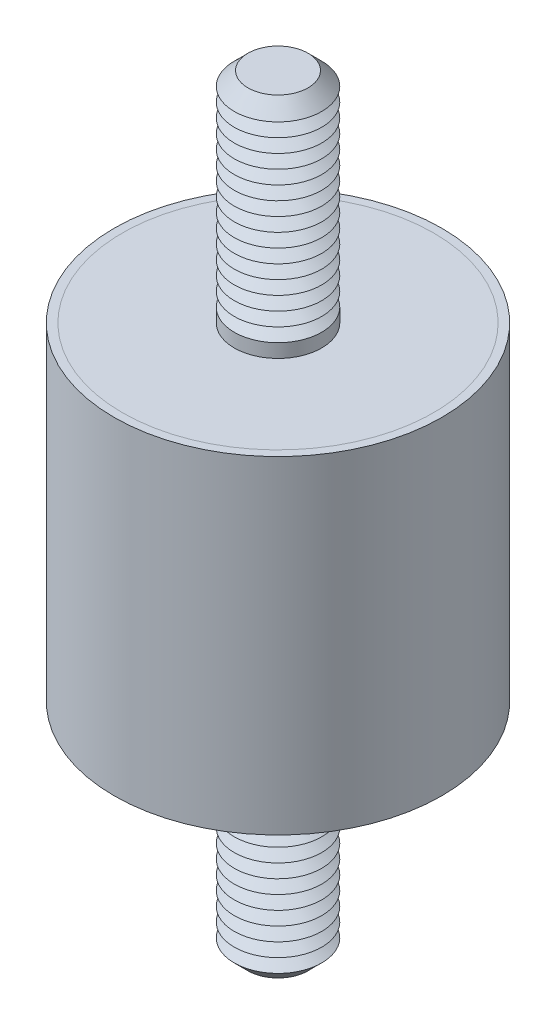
ISO-10303-21;
HEADER;
FILE_DESCRIPTION(('STEP AP214'),'2;1');
FILE_NAME('part.step','',(''),(''),'','','');
FILE_SCHEMA(('AUTOMOTIVE_DESIGN { 1 0 10303 214 1 1 1 1 }'));
ENDSEC;
DATA;
#1=APPLICATION_CONTEXT('core data for automotive mechanical design processes');
#2=APPLICATION_PROTOCOL_DEFINITION('international standard','automotive_design',2000,#1);
#3=PRODUCT_CONTEXT('',#1,'mechanical');
#4=PRODUCT('Part','Part','',(#3));
#5=PRODUCT_RELATED_PRODUCT_CATEGORY('part','',(#4));
#6=PRODUCT_DEFINITION_FORMATION('','',#4);
#7=PRODUCT_DEFINITION_CONTEXT('part definition',#1,'design');
#8=PRODUCT_DEFINITION('design','',#6,#7);
#9=PRODUCT_DEFINITION_SHAPE('','',#8);
#10=(LENGTH_UNIT() NAMED_UNIT(*) SI_UNIT(.MILLI.,.METRE.));
#11=(NAMED_UNIT(*) PLANE_ANGLE_UNIT() SI_UNIT($,.RADIAN.));
#12=(NAMED_UNIT(*) SI_UNIT($,.STERADIAN.) SOLID_ANGLE_UNIT());
#13=UNCERTAINTY_MEASURE_WITH_UNIT(LENGTH_MEASURE(1.E-05),#10,'distance_accuracy_value','');
#14=(GEOMETRIC_REPRESENTATION_CONTEXT(3) GLOBAL_UNCERTAINTY_ASSIGNED_CONTEXT((#13)) GLOBAL_UNIT_ASSIGNED_CONTEXT((#10,
#11,#12)) REPRESENTATION_CONTEXT('',''));
#15=CARTESIAN_POINT('',(0.,0.,0.));
#16=DIRECTION('',(0.,0.,1.));
#17=DIRECTION('',(1.,0.,0.));
#18=AXIS2_PLACEMENT_3D('',#15,#16,#17);
#19=CARTESIAN_POINT('',(0.,-35.,0.));
#20=DIRECTION('',(0.,1.,0.));
#21=DIRECTION('',(0.,0.,1.));
#22=AXIS2_PLACEMENT_3D('',#19,#20,#21);
#23=CYLINDRICAL_SURFACE('',#22,4.);
#24=CARTESIAN_POINT('',(0.,-15.,0.));
#25=DIRECTION('',(0.,-1.,0.));
#26=DIRECTION('',(0.,0.,-1.));
#27=AXIS2_PLACEMENT_3D('',#24,#25,#26);
#28=CIRCLE('',#27,4.);
#29=CARTESIAN_POINT('',(0.,-15.,-4.));
#30=VERTEX_POINT('',#29);
#31=EDGE_CURVE('P0_E21',#30,#30,#28,.T.);
#32=ORIENTED_EDGE('',*,*,#31,.T.);
#33=EDGE_LOOP('',(#32));
#34=FACE_BOUND('',#33,.T.);
#35=CARTESIAN_POINT('',(0.,-16.25,0.));
#36=DIRECTION('',(0.,1.,0.));
#37=DIRECTION('',(0.,0.,1.));
#38=AXIS2_PLACEMENT_3D('',#35,#36,#37);
#39=CIRCLE('',#38,4.);
#40=CARTESIAN_POINT('',(0.,-16.25,4.));
#41=VERTEX_POINT('',#40);
#42=EDGE_CURVE('P0_E33',#41,#41,#39,.T.);
#43=ORIENTED_EDGE('',*,*,#42,.T.);
#44=EDGE_LOOP('',(#43));
#45=FACE_BOUND('',#44,.T.);
#46=ADVANCED_FACE('P0_F14',(#34,#45),#23,.T.);
#47=CARTESIAN_POINT('',(0.,-15.,0.));
#48=DIRECTION('',(0.,1.,0.));
#49=DIRECTION('',(0.,0.,1.));
#50=AXIS2_PLACEMENT_3D('',#47,#48,#49);
#51=CYLINDRICAL_SURFACE('',#50,14.25);
#52=CARTESIAN_POINT('',(0.,-15.,0.));
#53=DIRECTION('',(0.,1.,0.));
#54=DIRECTION('',(0.,0.,1.));
#55=AXIS2_PLACEMENT_3D('',#52,#53,#54);
#56=CIRCLE('',#55,14.25);
#57=CARTESIAN_POINT('',(0.,-15.,14.25));
#58=VERTEX_POINT('',#57);
#59=EDGE_CURVE('P0_E25',#58,#58,#56,.T.);
#60=ORIENTED_EDGE('',*,*,#59,.T.);
#61=EDGE_LOOP('',(#60));
#62=FACE_BOUND('',#61,.T.);
#63=CARTESIAN_POINT('',(0.,-13.5,0.));
#64=DIRECTION('',(0.,1.,0.));
#65=DIRECTION('',(0.,0.,1.));
#66=AXIS2_PLACEMENT_3D('',#63,#64,#65);
#67=CIRCLE('',#66,14.25);
#68=CARTESIAN_POINT('',(0.,-13.5,14.25));
#69=VERTEX_POINT('',#68);
#70=EDGE_CURVE('P0_E30',#69,#69,#67,.T.);
#71=ORIENTED_EDGE('',*,*,#70,.F.);
#72=EDGE_LOOP('',(#71));
#73=FACE_BOUND('',#72,.T.);
#74=ADVANCED_FACE('P0_F145',(#62,#73),#51,.T.);
#75=CARTESIAN_POINT('',(0.,-15.,0.));
#76=DIRECTION('',(0.,1.,0.));
#77=DIRECTION('',(0.,0.,1.));
#78=AXIS2_PLACEMENT_3D('',#75,#76,#77);
#79=PLANE('',#78);
#80=ORIENTED_EDGE('',*,*,#31,.F.);
#81=EDGE_LOOP('',(#80));
#82=FACE_BOUND('',#81,.T.);
#83=ORIENTED_EDGE('',*,*,#59,.F.);
#84=EDGE_LOOP('',(#83));
#85=FACE_BOUND('',#84,.T.);
#86=ADVANCED_FACE('P0_F150',(#82,#85),#79,.F.);
#87=CARTESIAN_POINT('',(0.,-13.5,0.));
#88=DIRECTION('',(0.,1.,0.));
#89=DIRECTION('',(0.,0.,1.));
#90=AXIS2_PLACEMENT_3D('',#87,#88,#89);
#91=PLANE('',#90);
#92=ORIENTED_EDGE('',*,*,#70,.T.);
#93=EDGE_LOOP('',(#92));
#94=FACE_BOUND('',#93,.T.);
#95=ADVANCED_FACE('P0_F156',(#94),#91,.T.);
#96=CARTESIAN_POINT('',(0.,-16.25,0.));
#97=DIRECTION('',(0.,1.,0.));
#98=DIRECTION('',(0.,0.,1.));
#99=AXIS2_PLACEMENT_3D('',#96,#97,#98);
#100=CONICAL_SURFACE('',#99,4.,1.0471975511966);
#101=CARTESIAN_POINT('',(0.,-16.875,0.));
#102=DIRECTION('',(0.,1.,0.));
#103=DIRECTION('',(0.,0.,1.));
#104=AXIS2_PLACEMENT_3D('',#101,#102,#103);
#105=CIRCLE('',#104,2.91746824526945);
#106=CARTESIAN_POINT('',(0.,-16.875,2.91746824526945));
#107=VERTEX_POINT('',#106);
#108=EDGE_CURVE('P0_E39',#107,#107,#105,.T.);
#109=ORIENTED_EDGE('',*,*,#108,.T.);
#110=EDGE_LOOP('',(#109));
#111=FACE_BOUND('',#110,.T.);
#112=ORIENTED_EDGE('',*,*,#42,.F.);
#113=EDGE_LOOP('',(#112));
#114=FACE_BOUND('',#113,.T.);
#115=ADVANCED_FACE('P0_F159',(#111,#114),#100,.T.);
#116=CARTESIAN_POINT('',(0.,-16.875,0.));
#117=DIRECTION('',(0.,-1.,0.));
#118=DIRECTION('',(0.,0.,-1.));
#119=AXIS2_PLACEMENT_3D('',#116,#117,#118);
#120=CONICAL_SURFACE('',#119,2.91746824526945,1.04719755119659);
#121=CARTESIAN_POINT('',(0.,-17.5,0.));
#122=DIRECTION('',(0.,1.,0.));
#123=DIRECTION('',(0.,0.,1.));
#124=AXIS2_PLACEMENT_3D('',#121,#122,#123);
#125=CIRCLE('',#124,4.);
#126=CARTESIAN_POINT('',(0.,-17.5,4.));
#127=VERTEX_POINT('',#126);
#128=EDGE_CURVE('P0_E43',#127,#127,#125,.T.);
#129=ORIENTED_EDGE('',*,*,#128,.T.);
#130=EDGE_LOOP('',(#129));
#131=FACE_BOUND('',#130,.T.);
#132=ORIENTED_EDGE('',*,*,#108,.F.);
#133=EDGE_LOOP('',(#132));
#134=FACE_BOUND('',#133,.T.);
#135=ADVANCED_FACE('P0_F163',(#131,#134),#120,.T.);
#136=CARTESIAN_POINT('',(0.,-17.5,0.));
#137=DIRECTION('',(0.,1.,0.));
#138=DIRECTION('',(0.,0.,1.));
#139=AXIS2_PLACEMENT_3D('',#136,#137,#138);
#140=CONICAL_SURFACE('',#139,4.,1.0471975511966);
#141=CARTESIAN_POINT('',(0.,-18.125,0.));
#142=DIRECTION('',(0.,1.,0.));
#143=DIRECTION('',(0.,0.,1.));
#144=AXIS2_PLACEMENT_3D('',#141,#142,#143);
#145=CIRCLE('',#144,2.91746824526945);
#146=CARTESIAN_POINT('',(0.,-18.125,2.91746824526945));
#147=VERTEX_POINT('',#146);
#148=EDGE_CURVE('P0_E47',#147,#147,#145,.T.);
#149=ORIENTED_EDGE('',*,*,#148,.T.);
#150=EDGE_LOOP('',(#149));
#151=FACE_BOUND('',#150,.T.);
#152=ORIENTED_EDGE('',*,*,#128,.F.);
#153=EDGE_LOOP('',(#152));
#154=FACE_BOUND('',#153,.T.);
#155=ADVANCED_FACE('P0_F167',(#151,#154),#140,.T.);
#156=CARTESIAN_POINT('',(0.,-18.125,0.));
#157=DIRECTION('',(0.,-1.,0.));
#158=DIRECTION('',(0.,0.,-1.));
#159=AXIS2_PLACEMENT_3D('',#156,#157,#158);
#160=CONICAL_SURFACE('',#159,2.91746824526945,1.04719755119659);
#161=CARTESIAN_POINT('',(0.,-18.75,0.));
#162=DIRECTION('',(0.,1.,0.));
#163=DIRECTION('',(0.,0.,1.));
#164=AXIS2_PLACEMENT_3D('',#161,#162,#163);
#165=CIRCLE('',#164,4.);
#166=CARTESIAN_POINT('',(0.,-18.75,4.));
#167=VERTEX_POINT('',#166);
#168=EDGE_CURVE('P0_E52',#167,#167,#165,.T.);
#169=ORIENTED_EDGE('',*,*,#168,.T.);
#170=EDGE_LOOP('',(#169));
#171=FACE_BOUND('',#170,.T.);
#172=ORIENTED_EDGE('',*,*,#148,.F.);
#173=EDGE_LOOP('',(#172));
#174=FACE_BOUND('',#173,.T.);
#175=ADVANCED_FACE('P0_F174',(#171,#174),#160,.T.);
#176=CARTESIAN_POINT('',(0.,-18.75,0.));
#177=DIRECTION('',(0.,1.,0.));
#178=DIRECTION('',(0.,0.,1.));
#179=AXIS2_PLACEMENT_3D('',#176,#177,#178);
#180=CONICAL_SURFACE('',#179,4.,1.0471975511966);
#181=CARTESIAN_POINT('',(0.,-19.375,0.));
#182=DIRECTION('',(0.,1.,0.));
#183=DIRECTION('',(0.,0.,1.));
#184=AXIS2_PLACEMENT_3D('',#181,#182,#183);
#185=CIRCLE('',#184,2.91746824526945);
#186=CARTESIAN_POINT('',(0.,-19.375,2.91746824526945));
#187=VERTEX_POINT('',#186);
#188=EDGE_CURVE('P0_E55',#187,#187,#185,.T.);
#189=ORIENTED_EDGE('',*,*,#188,.T.);
#190=EDGE_LOOP('',(#189));
#191=FACE_BOUND('',#190,.T.);
#192=ORIENTED_EDGE('',*,*,#168,.F.);
#193=EDGE_LOOP('',(#192));
#194=FACE_BOUND('',#193,.T.);
#195=ADVANCED_FACE('P0_F178',(#191,#194),#180,.T.);
#196=CARTESIAN_POINT('',(0.,-19.375,0.));
#197=DIRECTION('',(0.,-1.,0.));
#198=DIRECTION('',(0.,0.,-1.));
#199=AXIS2_PLACEMENT_3D('',#196,#197,#198);
#200=CONICAL_SURFACE('',#199,2.91746824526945,1.04719755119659);
#201=CARTESIAN_POINT('',(0.,-20.,0.));
#202=DIRECTION('',(0.,1.,0.));
#203=DIRECTION('',(0.,0.,1.));
#204=AXIS2_PLACEMENT_3D('',#201,#202,#203);
#205=CIRCLE('',#204,4.);
#206=CARTESIAN_POINT('',(0.,-20.,4.));
#207=VERTEX_POINT('',#206);
#208=EDGE_CURVE('P0_E58',#207,#207,#205,.T.);
#209=ORIENTED_EDGE('',*,*,#208,.T.);
#210=EDGE_LOOP('',(#209));
#211=FACE_BOUND('',#210,.T.);
#212=ORIENTED_EDGE('',*,*,#188,.F.);
#213=EDGE_LOOP('',(#212));
#214=FACE_BOUND('',#213,.T.);
#215=ADVANCED_FACE('P0_F182',(#211,#214),#200,.T.);
#216=CARTESIAN_POINT('',(0.,-20.,0.));
#217=DIRECTION('',(0.,1.,0.));
#218=DIRECTION('',(0.,0.,1.));
#219=AXIS2_PLACEMENT_3D('',#216,#217,#218);
#220=CONICAL_SURFACE('',#219,4.,1.0471975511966);
#221=CARTESIAN_POINT('',(0.,-20.625,0.));
#222=DIRECTION('',(0.,1.,0.));
#223=DIRECTION('',(0.,0.,1.));
#224=AXIS2_PLACEMENT_3D('',#221,#222,#223);
#225=CIRCLE('',#224,2.91746824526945);
#226=CARTESIAN_POINT('',(0.,-20.625,2.91746824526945));
#227=VERTEX_POINT('',#226);
#228=EDGE_CURVE('P0_E61',#227,#227,#225,.T.);
#229=ORIENTED_EDGE('',*,*,#228,.T.);
#230=EDGE_LOOP('',(#229));
#231=FACE_BOUND('',#230,.T.);
#232=ORIENTED_EDGE('',*,*,#208,.F.);
#233=EDGE_LOOP('',(#232));
#234=FACE_BOUND('',#233,.T.);
#235=ADVANCED_FACE('P0_F186',(#231,#234),#220,.T.);
#236=CARTESIAN_POINT('',(0.,-20.625,0.));
#237=DIRECTION('',(0.,-1.,0.));
#238=DIRECTION('',(0.,0.,-1.));
#239=AXIS2_PLACEMENT_3D('',#236,#237,#238);
#240=CONICAL_SURFACE('',#239,2.91746824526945,1.04719755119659);
#241=CARTESIAN_POINT('',(0.,-21.25,0.));
#242=DIRECTION('',(0.,1.,0.));
#243=DIRECTION('',(0.,0.,1.));
#244=AXIS2_PLACEMENT_3D('',#241,#242,#243);
#245=CIRCLE('',#244,4.);
#246=CARTESIAN_POINT('',(0.,-21.25,4.));
#247=VERTEX_POINT('',#246);
#248=EDGE_CURVE('P0_E64',#247,#247,#245,.T.);
#249=ORIENTED_EDGE('',*,*,#248,.T.);
#250=EDGE_LOOP('',(#249));
#251=FACE_BOUND('',#250,.T.);
#252=ORIENTED_EDGE('',*,*,#228,.F.);
#253=EDGE_LOOP('',(#252));
#254=FACE_BOUND('',#253,.T.);
#255=ADVANCED_FACE('P0_F190',(#251,#254),#240,.T.);
#256=CARTESIAN_POINT('',(0.,-21.25,0.));
#257=DIRECTION('',(0.,1.,0.));
#258=DIRECTION('',(0.,0.,1.));
#259=AXIS2_PLACEMENT_3D('',#256,#257,#258);
#260=CONICAL_SURFACE('',#259,4.,1.0471975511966);
#261=CARTESIAN_POINT('',(0.,-21.875,0.));
#262=DIRECTION('',(0.,1.,0.));
#263=DIRECTION('',(0.,0.,1.));
#264=AXIS2_PLACEMENT_3D('',#261,#262,#263);
#265=CIRCLE('',#264,2.91746824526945);
#266=CARTESIAN_POINT('',(0.,-21.875,2.91746824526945));
#267=VERTEX_POINT('',#266);
#268=EDGE_CURVE('P0_E67',#267,#267,#265,.T.);
#269=ORIENTED_EDGE('',*,*,#268,.T.);
#270=EDGE_LOOP('',(#269));
#271=FACE_BOUND('',#270,.T.);
#272=ORIENTED_EDGE('',*,*,#248,.F.);
#273=EDGE_LOOP('',(#272));
#274=FACE_BOUND('',#273,.T.);
#275=ADVANCED_FACE('P0_F194',(#271,#274),#260,.T.);
#276=CARTESIAN_POINT('',(0.,-21.875,0.));
#277=DIRECTION('',(0.,-1.,0.));
#278=DIRECTION('',(0.,0.,-1.));
#279=AXIS2_PLACEMENT_3D('',#276,#277,#278);
#280=CONICAL_SURFACE('',#279,2.91746824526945,1.04719755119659);
#281=CARTESIAN_POINT('',(0.,-22.5,0.));
#282=DIRECTION('',(0.,1.,0.));
#283=DIRECTION('',(0.,0.,1.));
#284=AXIS2_PLACEMENT_3D('',#281,#282,#283);
#285=CIRCLE('',#284,4.);
#286=CARTESIAN_POINT('',(0.,-22.5,4.));
#287=VERTEX_POINT('',#286);
#288=EDGE_CURVE('P0_E70',#287,#287,#285,.T.);
#289=ORIENTED_EDGE('',*,*,#288,.T.);
#290=EDGE_LOOP('',(#289));
#291=FACE_BOUND('',#290,.T.);
#292=ORIENTED_EDGE('',*,*,#268,.F.);
#293=EDGE_LOOP('',(#292));
#294=FACE_BOUND('',#293,.T.);
#295=ADVANCED_FACE('P0_F198',(#291,#294),#280,.T.);
#296=CARTESIAN_POINT('',(0.,-22.5,0.));
#297=DIRECTION('',(0.,1.,0.));
#298=DIRECTION('',(0.,0.,1.));
#299=AXIS2_PLACEMENT_3D('',#296,#297,#298);
#300=CONICAL_SURFACE('',#299,4.,1.0471975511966);
#301=CARTESIAN_POINT('',(0.,-23.125,0.));
#302=DIRECTION('',(0.,1.,0.));
#303=DIRECTION('',(0.,0.,1.));
#304=AXIS2_PLACEMENT_3D('',#301,#302,#303);
#305=CIRCLE('',#304,2.91746824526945);
#306=CARTESIAN_POINT('',(0.,-23.125,2.91746824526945));
#307=VERTEX_POINT('',#306);
#308=EDGE_CURVE('P0_E73',#307,#307,#305,.T.);
#309=ORIENTED_EDGE('',*,*,#308,.T.);
#310=EDGE_LOOP('',(#309));
#311=FACE_BOUND('',#310,.T.);
#312=ORIENTED_EDGE('',*,*,#288,.F.);
#313=EDGE_LOOP('',(#312));
#314=FACE_BOUND('',#313,.T.);
#315=ADVANCED_FACE('P0_F202',(#311,#314),#300,.T.);
#316=CARTESIAN_POINT('',(0.,-23.125,0.));
#317=DIRECTION('',(0.,-1.,0.));
#318=DIRECTION('',(0.,0.,-1.));
#319=AXIS2_PLACEMENT_3D('',#316,#317,#318);
#320=CONICAL_SURFACE('',#319,2.91746824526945,1.04719755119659);
#321=CARTESIAN_POINT('',(0.,-23.75,0.));
#322=DIRECTION('',(0.,1.,0.));
#323=DIRECTION('',(0.,0.,1.));
#324=AXIS2_PLACEMENT_3D('',#321,#322,#323);
#325=CIRCLE('',#324,4.);
#326=CARTESIAN_POINT('',(0.,-23.75,4.));
#327=VERTEX_POINT('',#326);
#328=EDGE_CURVE('P0_E76',#327,#327,#325,.T.);
#329=ORIENTED_EDGE('',*,*,#328,.T.);
#330=EDGE_LOOP('',(#329));
#331=FACE_BOUND('',#330,.T.);
#332=ORIENTED_EDGE('',*,*,#308,.F.);
#333=EDGE_LOOP('',(#332));
#334=FACE_BOUND('',#333,.T.);
#335=ADVANCED_FACE('P0_F206',(#331,#334),#320,.T.);
#336=CARTESIAN_POINT('',(0.,-23.75,0.));
#337=DIRECTION('',(0.,1.,0.));
#338=DIRECTION('',(0.,0.,1.));
#339=AXIS2_PLACEMENT_3D('',#336,#337,#338);
#340=CONICAL_SURFACE('',#339,4.,1.0471975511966);
#341=CARTESIAN_POINT('',(0.,-24.375,0.));
#342=DIRECTION('',(0.,1.,0.));
#343=DIRECTION('',(0.,0.,1.));
#344=AXIS2_PLACEMENT_3D('',#341,#342,#343);
#345=CIRCLE('',#344,2.91746824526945);
#346=CARTESIAN_POINT('',(0.,-24.375,2.91746824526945));
#347=VERTEX_POINT('',#346);
#348=EDGE_CURVE('P0_E79',#347,#347,#345,.T.);
#349=ORIENTED_EDGE('',*,*,#348,.T.);
#350=EDGE_LOOP('',(#349));
#351=FACE_BOUND('',#350,.T.);
#352=ORIENTED_EDGE('',*,*,#328,.F.);
#353=EDGE_LOOP('',(#352));
#354=FACE_BOUND('',#353,.T.);
#355=ADVANCED_FACE('P0_F210',(#351,#354),#340,.T.);
#356=CARTESIAN_POINT('',(0.,-24.375,0.));
#357=DIRECTION('',(0.,-1.,0.));
#358=DIRECTION('',(0.,0.,-1.));
#359=AXIS2_PLACEMENT_3D('',#356,#357,#358);
#360=CONICAL_SURFACE('',#359,2.91746824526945,1.04719755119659);
#361=CARTESIAN_POINT('',(0.,-25.,0.));
#362=DIRECTION('',(0.,1.,0.));
#363=DIRECTION('',(0.,0.,1.));
#364=AXIS2_PLACEMENT_3D('',#361,#362,#363);
#365=CIRCLE('',#364,4.);
#366=CARTESIAN_POINT('',(0.,-25.,4.));
#367=VERTEX_POINT('',#366);
#368=EDGE_CURVE('P0_E82',#367,#367,#365,.T.);
#369=ORIENTED_EDGE('',*,*,#368,.T.);
#370=EDGE_LOOP('',(#369));
#371=FACE_BOUND('',#370,.T.);
#372=ORIENTED_EDGE('',*,*,#348,.F.);
#373=EDGE_LOOP('',(#372));
#374=FACE_BOUND('',#373,.T.);
#375=ADVANCED_FACE('P0_F214',(#371,#374),#360,.T.);
#376=CARTESIAN_POINT('',(0.,-25.,0.));
#377=DIRECTION('',(0.,1.,0.));
#378=DIRECTION('',(0.,0.,1.));
#379=AXIS2_PLACEMENT_3D('',#376,#377,#378);
#380=CONICAL_SURFACE('',#379,4.,1.0471975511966);
#381=CARTESIAN_POINT('',(0.,-25.625,0.));
#382=DIRECTION('',(0.,1.,0.));
#383=DIRECTION('',(0.,0.,1.));
#384=AXIS2_PLACEMENT_3D('',#381,#382,#383);
#385=CIRCLE('',#384,2.91746824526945);
#386=CARTESIAN_POINT('',(0.,-25.625,2.91746824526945));
#387=VERTEX_POINT('',#386);
#388=EDGE_CURVE('P0_E85',#387,#387,#385,.T.);
#389=ORIENTED_EDGE('',*,*,#388,.T.);
#390=EDGE_LOOP('',(#389));
#391=FACE_BOUND('',#390,.T.);
#392=ORIENTED_EDGE('',*,*,#368,.F.);
#393=EDGE_LOOP('',(#392));
#394=FACE_BOUND('',#393,.T.);
#395=ADVANCED_FACE('P0_F218',(#391,#394),#380,.T.);
#396=CARTESIAN_POINT('',(0.,-25.625,0.));
#397=DIRECTION('',(0.,-1.,0.));
#398=DIRECTION('',(0.,0.,-1.));
#399=AXIS2_PLACEMENT_3D('',#396,#397,#398);
#400=CONICAL_SURFACE('',#399,2.91746824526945,1.04719755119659);
#401=CARTESIAN_POINT('',(0.,-26.25,0.));
#402=DIRECTION('',(0.,1.,0.));
#403=DIRECTION('',(0.,0.,1.));
#404=AXIS2_PLACEMENT_3D('',#401,#402,#403);
#405=CIRCLE('',#404,4.);
#406=CARTESIAN_POINT('',(0.,-26.25,4.));
#407=VERTEX_POINT('',#406);
#408=EDGE_CURVE('P0_E88',#407,#407,#405,.T.);
#409=ORIENTED_EDGE('',*,*,#408,.T.);
#410=EDGE_LOOP('',(#409));
#411=FACE_BOUND('',#410,.T.);
#412=ORIENTED_EDGE('',*,*,#388,.F.);
#413=EDGE_LOOP('',(#412));
#414=FACE_BOUND('',#413,.T.);
#415=ADVANCED_FACE('P0_F222',(#411,#414),#400,.T.);
#416=CARTESIAN_POINT('',(0.,-26.25,0.));
#417=DIRECTION('',(0.,1.,0.));
#418=DIRECTION('',(0.,0.,1.));
#419=AXIS2_PLACEMENT_3D('',#416,#417,#418);
#420=CONICAL_SURFACE('',#419,4.,1.0471975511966);
#421=CARTESIAN_POINT('',(0.,-26.875,0.));
#422=DIRECTION('',(0.,1.,0.));
#423=DIRECTION('',(0.,0.,1.));
#424=AXIS2_PLACEMENT_3D('',#421,#422,#423);
#425=CIRCLE('',#424,2.91746824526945);
#426=CARTESIAN_POINT('',(0.,-26.875,2.91746824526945));
#427=VERTEX_POINT('',#426);
#428=EDGE_CURVE('P0_E91',#427,#427,#425,.T.);
#429=ORIENTED_EDGE('',*,*,#428,.T.);
#430=EDGE_LOOP('',(#429));
#431=FACE_BOUND('',#430,.T.);
#432=ORIENTED_EDGE('',*,*,#408,.F.);
#433=EDGE_LOOP('',(#432));
#434=FACE_BOUND('',#433,.T.);
#435=ADVANCED_FACE('P0_F226',(#431,#434),#420,.T.);
#436=CARTESIAN_POINT('',(0.,-26.875,0.));
#437=DIRECTION('',(0.,-1.,0.));
#438=DIRECTION('',(0.,0.,-1.));
#439=AXIS2_PLACEMENT_3D('',#436,#437,#438);
#440=CONICAL_SURFACE('',#439,2.91746824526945,1.04719755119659);
#441=CARTESIAN_POINT('',(0.,-27.5,0.));
#442=DIRECTION('',(0.,1.,0.));
#443=DIRECTION('',(0.,0.,1.));
#444=AXIS2_PLACEMENT_3D('',#441,#442,#443);
#445=CIRCLE('',#444,4.);
#446=CARTESIAN_POINT('',(0.,-27.5,4.));
#447=VERTEX_POINT('',#446);
#448=EDGE_CURVE('P0_E94',#447,#447,#445,.T.);
#449=ORIENTED_EDGE('',*,*,#448,.T.);
#450=EDGE_LOOP('',(#449));
#451=FACE_BOUND('',#450,.T.);
#452=ORIENTED_EDGE('',*,*,#428,.F.);
#453=EDGE_LOOP('',(#452));
#454=FACE_BOUND('',#453,.T.);
#455=ADVANCED_FACE('P0_F230',(#451,#454),#440,.T.);
#456=CARTESIAN_POINT('',(0.,-27.5,0.));
#457=DIRECTION('',(0.,1.,0.));
#458=DIRECTION('',(0.,0.,1.));
#459=AXIS2_PLACEMENT_3D('',#456,#457,#458);
#460=CONICAL_SURFACE('',#459,4.,1.0471975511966);
#461=CARTESIAN_POINT('',(0.,-28.125,0.));
#462=DIRECTION('',(0.,1.,0.));
#463=DIRECTION('',(0.,0.,1.));
#464=AXIS2_PLACEMENT_3D('',#461,#462,#463);
#465=CIRCLE('',#464,2.91746824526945);
#466=CARTESIAN_POINT('',(0.,-28.125,2.91746824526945));
#467=VERTEX_POINT('',#466);
#468=EDGE_CURVE('P0_E97',#467,#467,#465,.T.);
#469=ORIENTED_EDGE('',*,*,#468,.T.);
#470=EDGE_LOOP('',(#469));
#471=FACE_BOUND('',#470,.T.);
#472=ORIENTED_EDGE('',*,*,#448,.F.);
#473=EDGE_LOOP('',(#472));
#474=FACE_BOUND('',#473,.T.);
#475=ADVANCED_FACE('P0_F234',(#471,#474),#460,.T.);
#476=CARTESIAN_POINT('',(0.,-28.125,0.));
#477=DIRECTION('',(0.,-1.,0.));
#478=DIRECTION('',(0.,0.,-1.));
#479=AXIS2_PLACEMENT_3D('',#476,#477,#478);
#480=CONICAL_SURFACE('',#479,2.91746824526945,1.04719755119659);
#481=CARTESIAN_POINT('',(0.,-28.75,0.));
#482=DIRECTION('',(0.,1.,0.));
#483=DIRECTION('',(0.,0.,1.));
#484=AXIS2_PLACEMENT_3D('',#481,#482,#483);
#485=CIRCLE('',#484,4.);
#486=CARTESIAN_POINT('',(0.,-28.75,4.));
#487=VERTEX_POINT('',#486);
#488=EDGE_CURVE('P0_E100',#487,#487,#485,.T.);
#489=ORIENTED_EDGE('',*,*,#488,.T.);
#490=EDGE_LOOP('',(#489));
#491=FACE_BOUND('',#490,.T.);
#492=ORIENTED_EDGE('',*,*,#468,.F.);
#493=EDGE_LOOP('',(#492));
#494=FACE_BOUND('',#493,.T.);
#495=ADVANCED_FACE('P0_F238',(#491,#494),#480,.T.);
#496=CARTESIAN_POINT('',(0.,-28.75,0.));
#497=DIRECTION('',(0.,1.,0.));
#498=DIRECTION('',(0.,0.,1.));
#499=AXIS2_PLACEMENT_3D('',#496,#497,#498);
#500=CONICAL_SURFACE('',#499,4.,1.0471975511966);
#501=CARTESIAN_POINT('',(0.,-29.375,0.));
#502=DIRECTION('',(0.,1.,0.));
#503=DIRECTION('',(0.,0.,1.));
#504=AXIS2_PLACEMENT_3D('',#501,#502,#503);
#505=CIRCLE('',#504,2.91746824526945);
#506=CARTESIAN_POINT('',(0.,-29.375,2.91746824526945));
#507=VERTEX_POINT('',#506);
#508=EDGE_CURVE('P0_E103',#507,#507,#505,.T.);
#509=ORIENTED_EDGE('',*,*,#508,.T.);
#510=EDGE_LOOP('',(#509));
#511=FACE_BOUND('',#510,.T.);
#512=ORIENTED_EDGE('',*,*,#488,.F.);
#513=EDGE_LOOP('',(#512));
#514=FACE_BOUND('',#513,.T.);
#515=ADVANCED_FACE('P0_F242',(#511,#514),#500,.T.);
#516=CARTESIAN_POINT('',(0.,-29.375,0.));
#517=DIRECTION('',(0.,-1.,0.));
#518=DIRECTION('',(0.,0.,-1.));
#519=AXIS2_PLACEMENT_3D('',#516,#517,#518);
#520=CONICAL_SURFACE('',#519,2.91746824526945,1.04719755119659);
#521=CARTESIAN_POINT('',(0.,-30.,0.));
#522=DIRECTION('',(0.,1.,0.));
#523=DIRECTION('',(0.,0.,1.));
#524=AXIS2_PLACEMENT_3D('',#521,#522,#523);
#525=CIRCLE('',#524,4.);
#526=CARTESIAN_POINT('',(0.,-30.,4.));
#527=VERTEX_POINT('',#526);
#528=EDGE_CURVE('P0_E106',#527,#527,#525,.T.);
#529=ORIENTED_EDGE('',*,*,#528,.T.);
#530=EDGE_LOOP('',(#529));
#531=FACE_BOUND('',#530,.T.);
#532=ORIENTED_EDGE('',*,*,#508,.F.);
#533=EDGE_LOOP('',(#532));
#534=FACE_BOUND('',#533,.T.);
#535=ADVANCED_FACE('P0_F246',(#531,#534),#520,.T.);
#536=CARTESIAN_POINT('',(0.,-30.,0.));
#537=DIRECTION('',(0.,1.,0.));
#538=DIRECTION('',(0.,0.,1.));
#539=AXIS2_PLACEMENT_3D('',#536,#537,#538);
#540=CONICAL_SURFACE('',#539,4.,1.0471975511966);
#541=CARTESIAN_POINT('',(0.,-30.625,0.));
#542=DIRECTION('',(0.,1.,0.));
#543=DIRECTION('',(0.,0.,1.));
#544=AXIS2_PLACEMENT_3D('',#541,#542,#543);
#545=CIRCLE('',#544,2.91746824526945);
#546=CARTESIAN_POINT('',(0.,-30.625,2.91746824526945));
#547=VERTEX_POINT('',#546);
#548=EDGE_CURVE('P0_E109',#547,#547,#545,.T.);
#549=ORIENTED_EDGE('',*,*,#548,.T.);
#550=EDGE_LOOP('',(#549));
#551=FACE_BOUND('',#550,.T.);
#552=ORIENTED_EDGE('',*,*,#528,.F.);
#553=EDGE_LOOP('',(#552));
#554=FACE_BOUND('',#553,.T.);
#555=ADVANCED_FACE('P0_F250',(#551,#554),#540,.T.);
#556=CARTESIAN_POINT('',(0.,-30.625,0.));
#557=DIRECTION('',(0.,-1.,0.));
#558=DIRECTION('',(0.,0.,-1.));
#559=AXIS2_PLACEMENT_3D('',#556,#557,#558);
#560=CONICAL_SURFACE('',#559,2.91746824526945,1.04719755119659);
#561=CARTESIAN_POINT('',(0.,-31.25,0.));
#562=DIRECTION('',(0.,1.,0.));
#563=DIRECTION('',(0.,0.,1.));
#564=AXIS2_PLACEMENT_3D('',#561,#562,#563);
#565=CIRCLE('',#564,4.);
#566=CARTESIAN_POINT('',(0.,-31.25,4.));
#567=VERTEX_POINT('',#566);
#568=EDGE_CURVE('P0_E112',#567,#567,#565,.T.);
#569=ORIENTED_EDGE('',*,*,#568,.T.);
#570=EDGE_LOOP('',(#569));
#571=FACE_BOUND('',#570,.T.);
#572=ORIENTED_EDGE('',*,*,#548,.F.);
#573=EDGE_LOOP('',(#572));
#574=FACE_BOUND('',#573,.T.);
#575=ADVANCED_FACE('P0_F254',(#571,#574),#560,.T.);
#576=CARTESIAN_POINT('',(0.,-31.25,0.));
#577=DIRECTION('',(0.,1.,0.));
#578=DIRECTION('',(0.,0.,1.));
#579=AXIS2_PLACEMENT_3D('',#576,#577,#578);
#580=CONICAL_SURFACE('',#579,4.,1.0471975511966);
#581=CARTESIAN_POINT('',(0.,-31.875,0.));
#582=DIRECTION('',(0.,1.,0.));
#583=DIRECTION('',(0.,0.,1.));
#584=AXIS2_PLACEMENT_3D('',#581,#582,#583);
#585=CIRCLE('',#584,2.91746824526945);
#586=CARTESIAN_POINT('',(0.,-31.875,2.91746824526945));
#587=VERTEX_POINT('',#586);
#588=EDGE_CURVE('P0_E115',#587,#587,#585,.T.);
#589=ORIENTED_EDGE('',*,*,#588,.T.);
#590=EDGE_LOOP('',(#589));
#591=FACE_BOUND('',#590,.T.);
#592=ORIENTED_EDGE('',*,*,#568,.F.);
#593=EDGE_LOOP('',(#592));
#594=FACE_BOUND('',#593,.T.);
#595=ADVANCED_FACE('P0_F258',(#591,#594),#580,.T.);
#596=CARTESIAN_POINT('',(0.,-31.875,0.));
#597=DIRECTION('',(0.,-1.,0.));
#598=DIRECTION('',(0.,0.,-1.));
#599=AXIS2_PLACEMENT_3D('',#596,#597,#598);
#600=CONICAL_SURFACE('',#599,2.91746824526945,1.04719755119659);
#601=CARTESIAN_POINT('',(0.,-32.5,0.));
#602=DIRECTION('',(0.,1.,0.));
#603=DIRECTION('',(0.,0.,1.));
#604=AXIS2_PLACEMENT_3D('',#601,#602,#603);
#605=CIRCLE('',#604,4.);
#606=CARTESIAN_POINT('',(0.,-32.5,4.));
#607=VERTEX_POINT('',#606);
#608=EDGE_CURVE('P0_E118',#607,#607,#605,.T.);
#609=ORIENTED_EDGE('',*,*,#608,.T.);
#610=EDGE_LOOP('',(#609));
#611=FACE_BOUND('',#610,.T.);
#612=ORIENTED_EDGE('',*,*,#588,.F.);
#613=EDGE_LOOP('',(#612));
#614=FACE_BOUND('',#613,.T.);
#615=ADVANCED_FACE('P0_F142',(#611,#614),#600,.T.);
#616=CARTESIAN_POINT('',(0.,-32.5,0.));
#617=DIRECTION('',(0.,1.,0.));
#618=DIRECTION('',(0.,0.,1.));
#619=AXIS2_PLACEMENT_3D('',#616,#617,#618);
#620=CONICAL_SURFACE('',#619,4.,1.0471975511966);
#621=CARTESIAN_POINT('',(0.,-33.125,0.));
#622=DIRECTION('',(0.,1.,0.));
#623=DIRECTION('',(0.,0.,1.));
#624=AXIS2_PLACEMENT_3D('',#621,#622,#623);
#625=CIRCLE('',#624,2.91746824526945);
#626=CARTESIAN_POINT('',(0.,-33.125,2.91746824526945));
#627=VERTEX_POINT('',#626);
#628=EDGE_CURVE('P0_E124',#627,#627,#625,.T.);
#629=ORIENTED_EDGE('',*,*,#628,.T.);
#630=EDGE_LOOP('',(#629));
#631=FACE_BOUND('',#630,.T.);
#632=ORIENTED_EDGE('',*,*,#608,.F.);
#633=EDGE_LOOP('',(#632));
#634=FACE_BOUND('',#633,.T.);
#635=ADVANCED_FACE('P0_F128',(#631,#634),#620,.T.);
#636=CARTESIAN_POINT('',(0.,-33.125,0.));
#637=DIRECTION('',(0.,-1.,0.));
#638=DIRECTION('',(0.,0.,-1.));
#639=AXIS2_PLACEMENT_3D('',#636,#637,#638);
#640=CONICAL_SURFACE('',#639,2.91746824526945,1.04719755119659);
#641=CARTESIAN_POINT('',(0.,-33.75,0.));
#642=DIRECTION('',(0.,1.,0.));
#643=DIRECTION('',(0.,0.,1.));
#644=AXIS2_PLACEMENT_3D('',#641,#642,#643);
#645=CIRCLE('',#644,4.);
#646=CARTESIAN_POINT('',(0.,-33.75,4.));
#647=VERTEX_POINT('',#646);
#648=EDGE_CURVE('P0_E121',#647,#647,#645,.T.);
#649=ORIENTED_EDGE('',*,*,#648,.T.);
#650=EDGE_LOOP('',(#649));
#651=FACE_BOUND('',#650,.T.);
#652=ORIENTED_EDGE('',*,*,#628,.F.);
#653=EDGE_LOOP('',(#652));
#654=FACE_BOUND('',#653,.T.);
#655=ADVANCED_FACE('P0_F131',(#651,#654),#640,.T.);
#656=CARTESIAN_POINT('',(0.,-35.,0.));
#657=DIRECTION('',(0.,-1.,0.));
#658=DIRECTION('',(0.,0.,-1.));
#659=AXIS2_PLACEMENT_3D('',#656,#657,#658);
#660=PLANE('',#659);
#661=CARTESIAN_POINT('',(0.,-35.,0.));
#662=DIRECTION('',(0.,-1.,0.));
#663=DIRECTION('',(0.,0.,-1.));
#664=AXIS2_PLACEMENT_3D('',#661,#662,#663);
#665=CIRCLE('',#664,2.75000000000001);
#666=CARTESIAN_POINT('',(0.,-35.,-2.75000000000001));
#667=VERTEX_POINT('',#666);
#668=EDGE_CURVE('P0_E10',#667,#667,#665,.T.);
#669=ORIENTED_EDGE('',*,*,#668,.T.);
#670=EDGE_LOOP('',(#669));
#671=FACE_BOUND('',#670,.T.);
#672=ADVANCED_FACE('P0_F133',(#671),#660,.T.);
#673=CARTESIAN_POINT('',(0.,-35.,0.));
#674=DIRECTION('',(0.,1.,0.));
#675=DIRECTION('',(0.,0.,1.));
#676=AXIS2_PLACEMENT_3D('',#673,#674,#675);
#677=CONICAL_SURFACE('',#676,2.75000000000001,0.785398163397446);
#678=ORIENTED_EDGE('',*,*,#648,.F.);
#679=EDGE_LOOP('',(#678));
#680=FACE_BOUND('',#679,.T.);
#681=ORIENTED_EDGE('',*,*,#668,.F.);
#682=EDGE_LOOP('',(#681));
#683=FACE_BOUND('',#682,.T.);
#684=ADVANCED_FACE('P0_F16',(#680,#683),#677,.T.);
#685=CLOSED_SHELL('',(#46,#74,#86,#95,#115,#135,#155,#175,#195,#215,#235,#255,#275,#295,#315,
#335,#355,#375,#395,#415,#435,#455,#475,#495,#515,#535,#555,#575,#595,#615,#635,#655,#672,#684));
#686=MANIFOLD_SOLID_BREP('P0_B1',#685);
#687=CARTESIAN_POINT('',(0.,35.,0.));
#688=DIRECTION('',(0.,-1.,0.));
#689=DIRECTION('',(0.,0.,-1.));
#690=AXIS2_PLACEMENT_3D('',#687,#688,#689);
#691=CYLINDRICAL_SURFACE('',#690,4.);
#692=CARTESIAN_POINT('',(0.,16.25,0.));
#693=DIRECTION('',(0.,1.,0.));
#694=DIRECTION('',(0.,0.,1.));
#695=AXIS2_PLACEMENT_3D('',#692,#693,#694);
#696=CIRCLE('',#695,4.);
#697=CARTESIAN_POINT('',(0.,16.25,4.));
#698=VERTEX_POINT('',#697);
#699=EDGE_CURVE('P1_E33',#698,#698,#696,.T.);
#700=ORIENTED_EDGE('',*,*,#699,.F.);
#701=EDGE_LOOP('',(#700));
#702=FACE_BOUND('',#701,.T.);
#703=CARTESIAN_POINT('',(0.,15.,0.));
#704=DIRECTION('',(0.,1.,0.));
#705=DIRECTION('',(0.,0.,1.));
#706=AXIS2_PLACEMENT_3D('',#703,#704,#705);
#707=CIRCLE('',#706,4.);
#708=CARTESIAN_POINT('',(0.,15.,4.));
#709=VERTEX_POINT('',#708);
#710=EDGE_CURVE('P1_E21',#709,#709,#707,.T.);
#711=ORIENTED_EDGE('',*,*,#710,.T.);
#712=EDGE_LOOP('',(#711));
#713=FACE_BOUND('',#712,.T.);
#714=ADVANCED_FACE('P1_F14',(#702,#713),#691,.T.);
#715=CARTESIAN_POINT('',(0.,15.,0.));
#716=DIRECTION('',(0.,-1.,0.));
#717=DIRECTION('',(0.,0.,-1.));
#718=AXIS2_PLACEMENT_3D('',#715,#716,#717);
#719=CYLINDRICAL_SURFACE('',#718,14.25);
#720=CARTESIAN_POINT('',(0.,15.,0.));
#721=DIRECTION('',(0.,1.,0.));
#722=DIRECTION('',(0.,0.,1.));
#723=AXIS2_PLACEMENT_3D('',#720,#721,#722);
#724=CIRCLE('',#723,14.25);
#725=CARTESIAN_POINT('',(0.,15.,14.25));
#726=VERTEX_POINT('',#725);
#727=EDGE_CURVE('P1_E25',#726,#726,#724,.T.);
#728=ORIENTED_EDGE('',*,*,#727,.F.);
#729=EDGE_LOOP('',(#728));
#730=FACE_BOUND('',#729,.T.);
#731=CARTESIAN_POINT('',(0.,13.5,0.));
#732=DIRECTION('',(0.,1.,0.));
#733=DIRECTION('',(0.,0.,1.));
#734=AXIS2_PLACEMENT_3D('',#731,#732,#733);
#735=CIRCLE('',#734,14.25);
#736=CARTESIAN_POINT('',(0.,13.5,14.25));
#737=VERTEX_POINT('',#736);
#738=EDGE_CURVE('P1_E30',#737,#737,#735,.T.);
#739=ORIENTED_EDGE('',*,*,#738,.T.);
#740=EDGE_LOOP('',(#739));
#741=FACE_BOUND('',#740,.T.);
#742=ADVANCED_FACE('P1_F292',(#730,#741),#719,.T.);
#743=CARTESIAN_POINT('',(0.,15.,0.));
#744=DIRECTION('',(0.,1.,0.));
#745=DIRECTION('',(0.,0.,1.));
#746=AXIS2_PLACEMENT_3D('',#743,#744,#745);
#747=PLANE('',#746);
#748=ORIENTED_EDGE('',*,*,#710,.F.);
#749=EDGE_LOOP('',(#748));
#750=FACE_BOUND('',#749,.T.);
#751=ORIENTED_EDGE('',*,*,#727,.T.);
#752=EDGE_LOOP('',(#751));
#753=FACE_BOUND('',#752,.T.);
#754=ADVANCED_FACE('P1_F298',(#750,#753),#747,.T.);
#755=CARTESIAN_POINT('',(0.,13.5,0.));
#756=DIRECTION('',(0.,1.,0.));
#757=DIRECTION('',(0.,0.,1.));
#758=AXIS2_PLACEMENT_3D('',#755,#756,#757);
#759=PLANE('',#758);
#760=ORIENTED_EDGE('',*,*,#738,.F.);
#761=EDGE_LOOP('',(#760));
#762=FACE_BOUND('',#761,.T.);
#763=ADVANCED_FACE('P1_F288',(#762),#759,.F.);
#764=CARTESIAN_POINT('',(0.,16.25,0.));
#765=DIRECTION('',(0.,-1.,0.));
#766=DIRECTION('',(0.,0.,-1.));
#767=AXIS2_PLACEMENT_3D('',#764,#765,#766);
#768=CONICAL_SURFACE('',#767,4.,1.0471975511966);
#769=CARTESIAN_POINT('',(0.,16.875,0.));
#770=DIRECTION('',(0.,1.,0.));
#771=DIRECTION('',(0.,0.,1.));
#772=AXIS2_PLACEMENT_3D('',#769,#770,#771);
#773=CIRCLE('',#772,2.91746824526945);
#774=CARTESIAN_POINT('',(0.,16.875,2.91746824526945));
#775=VERTEX_POINT('',#774);
#776=EDGE_CURVE('P1_E39',#775,#775,#773,.T.);
#777=ORIENTED_EDGE('',*,*,#776,.F.);
#778=EDGE_LOOP('',(#777));
#779=FACE_BOUND('',#778,.T.);
#780=ORIENTED_EDGE('',*,*,#699,.T.);
#781=EDGE_LOOP('',(#780));
#782=FACE_BOUND('',#781,.T.);
#783=ADVANCED_FACE('P1_F282',(#779,#782),#768,.T.);
#784=CARTESIAN_POINT('',(0.,16.875,0.));
#785=DIRECTION('',(0.,1.,0.));
#786=DIRECTION('',(0.,0.,1.));
#787=AXIS2_PLACEMENT_3D('',#784,#785,#786);
#788=CONICAL_SURFACE('',#787,2.91746824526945,1.04719755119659);
#789=CARTESIAN_POINT('',(0.,17.5,0.));
#790=DIRECTION('',(0.,1.,0.));
#791=DIRECTION('',(0.,0.,1.));
#792=AXIS2_PLACEMENT_3D('',#789,#790,#791);
#793=CIRCLE('',#792,4.);
#794=CARTESIAN_POINT('',(0.,17.5,4.));
#795=VERTEX_POINT('',#794);
#796=EDGE_CURVE('P1_E43',#795,#795,#793,.T.);
#797=ORIENTED_EDGE('',*,*,#796,.F.);
#798=EDGE_LOOP('',(#797));
#799=FACE_BOUND('',#798,.T.);
#800=ORIENTED_EDGE('',*,*,#776,.T.);
#801=EDGE_LOOP('',(#800));
#802=FACE_BOUND('',#801,.T.);
#803=ADVANCED_FACE('P1_F277',(#799,#802),#788,.T.);
#804=CARTESIAN_POINT('',(0.,17.5,0.));
#805=DIRECTION('',(0.,-1.,0.));
#806=DIRECTION('',(0.,0.,-1.));
#807=AXIS2_PLACEMENT_3D('',#804,#805,#806);
#808=CONICAL_SURFACE('',#807,4.,1.0471975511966);
#809=CARTESIAN_POINT('',(0.,18.125,0.));
#810=DIRECTION('',(0.,1.,0.));
#811=DIRECTION('',(0.,0.,1.));
#812=AXIS2_PLACEMENT_3D('',#809,#810,#811);
#813=CIRCLE('',#812,2.91746824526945);
#814=CARTESIAN_POINT('',(0.,18.125,2.91746824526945));
#815=VERTEX_POINT('',#814);
#816=EDGE_CURVE('P1_E47',#815,#815,#813,.T.);
#817=ORIENTED_EDGE('',*,*,#816,.F.);
#818=EDGE_LOOP('',(#817));
#819=FACE_BOUND('',#818,.T.);
#820=ORIENTED_EDGE('',*,*,#796,.T.);
#821=EDGE_LOOP('',(#820));
#822=FACE_BOUND('',#821,.T.);
#823=ADVANCED_FACE('P1_F271',(#819,#822),#808,.T.);
#824=CARTESIAN_POINT('',(0.,18.125,0.));
#825=DIRECTION('',(0.,1.,0.));
#826=DIRECTION('',(0.,0.,1.));
#827=AXIS2_PLACEMENT_3D('',#824,#825,#826);
#828=CONICAL_SURFACE('',#827,2.91746824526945,1.04719755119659);
#829=CARTESIAN_POINT('',(0.,18.75,0.));
#830=DIRECTION('',(0.,1.,0.));
#831=DIRECTION('',(0.,0.,1.));
#832=AXIS2_PLACEMENT_3D('',#829,#830,#831);
#833=CIRCLE('',#832,4.);
#834=CARTESIAN_POINT('',(0.,18.75,4.));
#835=VERTEX_POINT('',#834);
#836=EDGE_CURVE('P1_E52',#835,#835,#833,.T.);
#837=ORIENTED_EDGE('',*,*,#836,.F.);
#838=EDGE_LOOP('',(#837));
#839=FACE_BOUND('',#838,.T.);
#840=ORIENTED_EDGE('',*,*,#816,.T.);
#841=EDGE_LOOP('',(#840));
#842=FACE_BOUND('',#841,.T.);
#843=ADVANCED_FACE('P1_F265',(#839,#842),#828,.T.);
#844=CARTESIAN_POINT('',(0.,18.75,0.));
#845=DIRECTION('',(0.,-1.,0.));
#846=DIRECTION('',(0.,0.,-1.));
#847=AXIS2_PLACEMENT_3D('',#844,#845,#846);
#848=CONICAL_SURFACE('',#847,4.,1.0471975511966);
#849=CARTESIAN_POINT('',(0.,19.375,0.));
#850=DIRECTION('',(0.,1.,0.));
#851=DIRECTION('',(0.,0.,1.));
#852=AXIS2_PLACEMENT_3D('',#849,#850,#851);
#853=CIRCLE('',#852,2.91746824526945);
#854=CARTESIAN_POINT('',(0.,19.375,2.91746824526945));
#855=VERTEX_POINT('',#854);
#856=EDGE_CURVE('P1_E55',#855,#855,#853,.T.);
#857=ORIENTED_EDGE('',*,*,#856,.F.);
#858=EDGE_LOOP('',(#857));
#859=FACE_BOUND('',#858,.T.);
#860=ORIENTED_EDGE('',*,*,#836,.T.);
#861=EDGE_LOOP('',(#860));
#862=FACE_BOUND('',#861,.T.);
#863=ADVANCED_FACE('P1_F259',(#859,#862),#848,.T.);
#864=CARTESIAN_POINT('',(0.,19.375,0.));
#865=DIRECTION('',(0.,1.,0.));
#866=DIRECTION('',(0.,0.,1.));
#867=AXIS2_PLACEMENT_3D('',#864,#865,#866);
#868=CONICAL_SURFACE('',#867,2.91746824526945,1.04719755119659);
#869=CARTESIAN_POINT('',(0.,20.,0.));
#870=DIRECTION('',(0.,1.,0.));
#871=DIRECTION('',(0.,0.,1.));
#872=AXIS2_PLACEMENT_3D('',#869,#870,#871);
#873=CIRCLE('',#872,4.);
#874=CARTESIAN_POINT('',(0.,20.,4.));
#875=VERTEX_POINT('',#874);
#876=EDGE_CURVE('P1_E58',#875,#875,#873,.T.);
#877=ORIENTED_EDGE('',*,*,#876,.F.);
#878=EDGE_LOOP('',(#877));
#879=FACE_BOUND('',#878,.T.);
#880=ORIENTED_EDGE('',*,*,#856,.T.);
#881=EDGE_LOOP('',(#880));
#882=FACE_BOUND('',#881,.T.);
#883=ADVANCED_FACE('P1_F253',(#879,#882),#868,.T.);
#884=CARTESIAN_POINT('',(0.,20.,0.));
#885=DIRECTION('',(0.,-1.,0.));
#886=DIRECTION('',(0.,0.,-1.));
#887=AXIS2_PLACEMENT_3D('',#884,#885,#886);
#888=CONICAL_SURFACE('',#887,4.,1.0471975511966);
#889=CARTESIAN_POINT('',(0.,20.625,0.));
#890=DIRECTION('',(0.,1.,0.));
#891=DIRECTION('',(0.,0.,1.));
#892=AXIS2_PLACEMENT_3D('',#889,#890,#891);
#893=CIRCLE('',#892,2.91746824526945);
#894=CARTESIAN_POINT('',(0.,20.625,2.91746824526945));
#895=VERTEX_POINT('',#894);
#896=EDGE_CURVE('P1_E61',#895,#895,#893,.T.);
#897=ORIENTED_EDGE('',*,*,#896,.F.);
#898=EDGE_LOOP('',(#897));
#899=FACE_BOUND('',#898,.T.);
#900=ORIENTED_EDGE('',*,*,#876,.T.);
#901=EDGE_LOOP('',(#900));
#902=FACE_BOUND('',#901,.T.);
#903=ADVANCED_FACE('P1_F247',(#899,#902),#888,.T.);
#904=CARTESIAN_POINT('',(0.,20.625,0.));
#905=DIRECTION('',(0.,1.,0.));
#906=DIRECTION('',(0.,0.,1.));
#907=AXIS2_PLACEMENT_3D('',#904,#905,#906);
#908=CONICAL_SURFACE('',#907,2.91746824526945,1.04719755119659);
#909=CARTESIAN_POINT('',(0.,21.25,0.));
#910=DIRECTION('',(0.,1.,0.));
#911=DIRECTION('',(0.,0.,1.));
#912=AXIS2_PLACEMENT_3D('',#909,#910,#911);
#913=CIRCLE('',#912,4.);
#914=CARTESIAN_POINT('',(0.,21.25,4.));
#915=VERTEX_POINT('',#914);
#916=EDGE_CURVE('P1_E64',#915,#915,#913,.T.);
#917=ORIENTED_EDGE('',*,*,#916,.F.);
#918=EDGE_LOOP('',(#917));
#919=FACE_BOUND('',#918,.T.);
#920=ORIENTED_EDGE('',*,*,#896,.T.);
#921=EDGE_LOOP('',(#920));
#922=FACE_BOUND('',#921,.T.);
#923=ADVANCED_FACE('P1_F241',(#919,#922),#908,.T.);
#924=CARTESIAN_POINT('',(0.,21.25,0.));
#925=DIRECTION('',(0.,-1.,0.));
#926=DIRECTION('',(0.,0.,-1.));
#927=AXIS2_PLACEMENT_3D('',#924,#925,#926);
#928=CONICAL_SURFACE('',#927,4.,1.0471975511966);
#929=CARTESIAN_POINT('',(0.,21.875,0.));
#930=DIRECTION('',(0.,1.,0.));
#931=DIRECTION('',(0.,0.,1.));
#932=AXIS2_PLACEMENT_3D('',#929,#930,#931);
#933=CIRCLE('',#932,2.91746824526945);
#934=CARTESIAN_POINT('',(0.,21.875,2.91746824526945));
#935=VERTEX_POINT('',#934);
#936=EDGE_CURVE('P1_E67',#935,#935,#933,.T.);
#937=ORIENTED_EDGE('',*,*,#936,.F.);
#938=EDGE_LOOP('',(#937));
#939=FACE_BOUND('',#938,.T.);
#940=ORIENTED_EDGE('',*,*,#916,.T.);
#941=EDGE_LOOP('',(#940));
#942=FACE_BOUND('',#941,.T.);
#943=ADVANCED_FACE('P1_F235',(#939,#942),#928,.T.);
#944=CARTESIAN_POINT('',(0.,21.875,0.));
#945=DIRECTION('',(0.,1.,0.));
#946=DIRECTION('',(0.,0.,1.));
#947=AXIS2_PLACEMENT_3D('',#944,#945,#946);
#948=CONICAL_SURFACE('',#947,2.91746824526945,1.04719755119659);
#949=CARTESIAN_POINT('',(0.,22.5,0.));
#950=DIRECTION('',(0.,1.,0.));
#951=DIRECTION('',(0.,0.,1.));
#952=AXIS2_PLACEMENT_3D('',#949,#950,#951);
#953=CIRCLE('',#952,4.);
#954=CARTESIAN_POINT('',(0.,22.5,4.));
#955=VERTEX_POINT('',#954);
#956=EDGE_CURVE('P1_E70',#955,#955,#953,.T.);
#957=ORIENTED_EDGE('',*,*,#956,.F.);
#958=EDGE_LOOP('',(#957));
#959=FACE_BOUND('',#958,.T.);
#960=ORIENTED_EDGE('',*,*,#936,.T.);
#961=EDGE_LOOP('',(#960));
#962=FACE_BOUND('',#961,.T.);
#963=ADVANCED_FACE('P1_F229',(#959,#962),#948,.T.);
#964=CARTESIAN_POINT('',(0.,22.5,0.));
#965=DIRECTION('',(0.,-1.,0.));
#966=DIRECTION('',(0.,0.,-1.));
#967=AXIS2_PLACEMENT_3D('',#964,#965,#966);
#968=CONICAL_SURFACE('',#967,4.,1.0471975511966);
#969=CARTESIAN_POINT('',(0.,23.125,0.));
#970=DIRECTION('',(0.,1.,0.));
#971=DIRECTION('',(0.,0.,1.));
#972=AXIS2_PLACEMENT_3D('',#969,#970,#971);
#973=CIRCLE('',#972,2.91746824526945);
#974=CARTESIAN_POINT('',(0.,23.125,2.91746824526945));
#975=VERTEX_POINT('',#974);
#976=EDGE_CURVE('P1_E73',#975,#975,#973,.T.);
#977=ORIENTED_EDGE('',*,*,#976,.F.);
#978=EDGE_LOOP('',(#977));
#979=FACE_BOUND('',#978,.T.);
#980=ORIENTED_EDGE('',*,*,#956,.T.);
#981=EDGE_LOOP('',(#980));
#982=FACE_BOUND('',#981,.T.);
#983=ADVANCED_FACE('P1_F223',(#979,#982),#968,.T.);
#984=CARTESIAN_POINT('',(0.,23.125,0.));
#985=DIRECTION('',(0.,1.,0.));
#986=DIRECTION('',(0.,0.,1.));
#987=AXIS2_PLACEMENT_3D('',#984,#985,#986);
#988=CONICAL_SURFACE('',#987,2.91746824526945,1.04719755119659);
#989=CARTESIAN_POINT('',(0.,23.75,0.));
#990=DIRECTION('',(0.,1.,0.));
#991=DIRECTION('',(0.,0.,1.));
#992=AXIS2_PLACEMENT_3D('',#989,#990,#991);
#993=CIRCLE('',#992,4.);
#994=CARTESIAN_POINT('',(0.,23.75,4.));
#995=VERTEX_POINT('',#994);
#996=EDGE_CURVE('P1_E76',#995,#995,#993,.T.);
#997=ORIENTED_EDGE('',*,*,#996,.F.);
#998=EDGE_LOOP('',(#997));
#999=FACE_BOUND('',#998,.T.);
#1000=ORIENTED_EDGE('',*,*,#976,.T.);
#1001=EDGE_LOOP('',(#1000));
#1002=FACE_BOUND('',#1001,.T.);
#1003=ADVANCED_FACE('P1_F217',(#999,#1002),#988,.T.);
#1004=CARTESIAN_POINT('',(0.,23.75,0.));
#1005=DIRECTION('',(0.,-1.,0.));
#1006=DIRECTION('',(0.,0.,-1.));
#1007=AXIS2_PLACEMENT_3D('',#1004,#1005,#1006);
#1008=CONICAL_SURFACE('',#1007,4.,1.0471975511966);
#1009=CARTESIAN_POINT('',(0.,24.375,0.));
#1010=DIRECTION('',(0.,1.,0.));
#1011=DIRECTION('',(0.,0.,1.));
#1012=AXIS2_PLACEMENT_3D('',#1009,#1010,#1011);
#1013=CIRCLE('',#1012,2.91746824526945);
#1014=CARTESIAN_POINT('',(0.,24.375,2.91746824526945));
#1015=VERTEX_POINT('',#1014);
#1016=EDGE_CURVE('P1_E79',#1015,#1015,#1013,.T.);
#1017=ORIENTED_EDGE('',*,*,#1016,.F.);
#1018=EDGE_LOOP('',(#1017));
#1019=FACE_BOUND('',#1018,.T.);
#1020=ORIENTED_EDGE('',*,*,#996,.T.);
#1021=EDGE_LOOP('',(#1020));
#1022=FACE_BOUND('',#1021,.T.);
#1023=ADVANCED_FACE('P1_F211',(#1019,#1022),#1008,.T.);
#1024=CARTESIAN_POINT('',(0.,24.375,0.));
#1025=DIRECTION('',(0.,1.,0.));
#1026=DIRECTION('',(0.,0.,1.));
#1027=AXIS2_PLACEMENT_3D('',#1024,#1025,#1026);
#1028=CONICAL_SURFACE('',#1027,2.91746824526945,1.04719755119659);
#1029=CARTESIAN_POINT('',(0.,25.,0.));
#1030=DIRECTION('',(0.,1.,0.));
#1031=DIRECTION('',(0.,0.,1.));
#1032=AXIS2_PLACEMENT_3D('',#1029,#1030,#1031);
#1033=CIRCLE('',#1032,4.);
#1034=CARTESIAN_POINT('',(0.,25.,4.));
#1035=VERTEX_POINT('',#1034);
#1036=EDGE_CURVE('P1_E82',#1035,#1035,#1033,.T.);
#1037=ORIENTED_EDGE('',*,*,#1036,.F.);
#1038=EDGE_LOOP('',(#1037));
#1039=FACE_BOUND('',#1038,.T.);
#1040=ORIENTED_EDGE('',*,*,#1016,.T.);
#1041=EDGE_LOOP('',(#1040));
#1042=FACE_BOUND('',#1041,.T.);
#1043=ADVANCED_FACE('P1_F205',(#1039,#1042),#1028,.T.);
#1044=CARTESIAN_POINT('',(0.,25.,0.));
#1045=DIRECTION('',(0.,-1.,0.));
#1046=DIRECTION('',(0.,0.,-1.));
#1047=AXIS2_PLACEMENT_3D('',#1044,#1045,#1046);
#1048=CONICAL_SURFACE('',#1047,4.,1.0471975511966);
#1049=CARTESIAN_POINT('',(0.,25.625,0.));
#1050=DIRECTION('',(0.,1.,0.));
#1051=DIRECTION('',(0.,0.,1.));
#1052=AXIS2_PLACEMENT_3D('',#1049,#1050,#1051);
#1053=CIRCLE('',#1052,2.91746824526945);
#1054=CARTESIAN_POINT('',(0.,25.625,2.91746824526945));
#1055=VERTEX_POINT('',#1054);
#1056=EDGE_CURVE('P1_E85',#1055,#1055,#1053,.T.);
#1057=ORIENTED_EDGE('',*,*,#1056,.F.);
#1058=EDGE_LOOP('',(#1057));
#1059=FACE_BOUND('',#1058,.T.);
#1060=ORIENTED_EDGE('',*,*,#1036,.T.);
#1061=EDGE_LOOP('',(#1060));
#1062=FACE_BOUND('',#1061,.T.);
#1063=ADVANCED_FACE('P1_F199',(#1059,#1062),#1048,.T.);
#1064=CARTESIAN_POINT('',(0.,25.625,0.));
#1065=DIRECTION('',(0.,1.,0.));
#1066=DIRECTION('',(0.,0.,1.));
#1067=AXIS2_PLACEMENT_3D('',#1064,#1065,#1066);
#1068=CONICAL_SURFACE('',#1067,2.91746824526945,1.04719755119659);
#1069=CARTESIAN_POINT('',(0.,26.25,0.));
#1070=DIRECTION('',(0.,1.,0.));
#1071=DIRECTION('',(0.,0.,1.));
#1072=AXIS2_PLACEMENT_3D('',#1069,#1070,#1071);
#1073=CIRCLE('',#1072,4.);
#1074=CARTESIAN_POINT('',(0.,26.25,4.));
#1075=VERTEX_POINT('',#1074);
#1076=EDGE_CURVE('P1_E88',#1075,#1075,#1073,.T.);
#1077=ORIENTED_EDGE('',*,*,#1076,.F.);
#1078=EDGE_LOOP('',(#1077));
#1079=FACE_BOUND('',#1078,.T.);
#1080=ORIENTED_EDGE('',*,*,#1056,.T.);
#1081=EDGE_LOOP('',(#1080));
#1082=FACE_BOUND('',#1081,.T.);
#1083=ADVANCED_FACE('P1_F193',(#1079,#1082),#1068,.T.);
#1084=CARTESIAN_POINT('',(0.,26.25,0.));
#1085=DIRECTION('',(0.,-1.,0.));
#1086=DIRECTION('',(0.,0.,-1.));
#1087=AXIS2_PLACEMENT_3D('',#1084,#1085,#1086);
#1088=CONICAL_SURFACE('',#1087,4.,1.0471975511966);
#1089=CARTESIAN_POINT('',(0.,26.875,0.));
#1090=DIRECTION('',(0.,1.,0.));
#1091=DIRECTION('',(0.,0.,1.));
#1092=AXIS2_PLACEMENT_3D('',#1089,#1090,#1091);
#1093=CIRCLE('',#1092,2.91746824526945);
#1094=CARTESIAN_POINT('',(0.,26.875,2.91746824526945));
#1095=VERTEX_POINT('',#1094);
#1096=EDGE_CURVE('P1_E91',#1095,#1095,#1093,.T.);
#1097=ORIENTED_EDGE('',*,*,#1096,.F.);
#1098=EDGE_LOOP('',(#1097));
#1099=FACE_BOUND('',#1098,.T.);
#1100=ORIENTED_EDGE('',*,*,#1076,.T.);
#1101=EDGE_LOOP('',(#1100));
#1102=FACE_BOUND('',#1101,.T.);
#1103=ADVANCED_FACE('P1_F187',(#1099,#1102),#1088,.T.);
#1104=CARTESIAN_POINT('',(0.,26.875,0.));
#1105=DIRECTION('',(0.,1.,0.));
#1106=DIRECTION('',(0.,0.,1.));
#1107=AXIS2_PLACEMENT_3D('',#1104,#1105,#1106);
#1108=CONICAL_SURFACE('',#1107,2.91746824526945,1.04719755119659);
#1109=CARTESIAN_POINT('',(0.,27.5,0.));
#1110=DIRECTION('',(0.,1.,0.));
#1111=DIRECTION('',(0.,0.,1.));
#1112=AXIS2_PLACEMENT_3D('',#1109,#1110,#1111);
#1113=CIRCLE('',#1112,4.);
#1114=CARTESIAN_POINT('',(0.,27.5,4.));
#1115=VERTEX_POINT('',#1114);
#1116=EDGE_CURVE('P1_E94',#1115,#1115,#1113,.T.);
#1117=ORIENTED_EDGE('',*,*,#1116,.F.);
#1118=EDGE_LOOP('',(#1117));
#1119=FACE_BOUND('',#1118,.T.);
#1120=ORIENTED_EDGE('',*,*,#1096,.T.);
#1121=EDGE_LOOP('',(#1120));
#1122=FACE_BOUND('',#1121,.T.);
#1123=ADVANCED_FACE('P1_F181',(#1119,#1122),#1108,.T.);
#1124=CARTESIAN_POINT('',(0.,27.5,0.));
#1125=DIRECTION('',(0.,-1.,0.));
#1126=DIRECTION('',(0.,0.,-1.));
#1127=AXIS2_PLACEMENT_3D('',#1124,#1125,#1126);
#1128=CONICAL_SURFACE('',#1127,4.,1.0471975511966);
#1129=CARTESIAN_POINT('',(0.,28.125,0.));
#1130=DIRECTION('',(0.,1.,0.));
#1131=DIRECTION('',(0.,0.,1.));
#1132=AXIS2_PLACEMENT_3D('',#1129,#1130,#1131);
#1133=CIRCLE('',#1132,2.91746824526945);
#1134=CARTESIAN_POINT('',(0.,28.125,2.91746824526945));
#1135=VERTEX_POINT('',#1134);
#1136=EDGE_CURVE('P1_E97',#1135,#1135,#1133,.T.);
#1137=ORIENTED_EDGE('',*,*,#1136,.F.);
#1138=EDGE_LOOP('',(#1137));
#1139=FACE_BOUND('',#1138,.T.);
#1140=ORIENTED_EDGE('',*,*,#1116,.T.);
#1141=EDGE_LOOP('',(#1140));
#1142=FACE_BOUND('',#1141,.T.);
#1143=ADVANCED_FACE('P1_F175',(#1139,#1142),#1128,.T.);
#1144=CARTESIAN_POINT('',(0.,28.125,0.));
#1145=DIRECTION('',(0.,1.,0.));
#1146=DIRECTION('',(0.,0.,1.));
#1147=AXIS2_PLACEMENT_3D('',#1144,#1145,#1146);
#1148=CONICAL_SURFACE('',#1147,2.91746824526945,1.04719755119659);
#1149=CARTESIAN_POINT('',(0.,28.75,0.));
#1150=DIRECTION('',(0.,1.,0.));
#1151=DIRECTION('',(0.,0.,1.));
#1152=AXIS2_PLACEMENT_3D('',#1149,#1150,#1151);
#1153=CIRCLE('',#1152,4.);
#1154=CARTESIAN_POINT('',(0.,28.75,4.));
#1155=VERTEX_POINT('',#1154);
#1156=EDGE_CURVE('P1_E100',#1155,#1155,#1153,.T.);
#1157=ORIENTED_EDGE('',*,*,#1156,.F.);
#1158=EDGE_LOOP('',(#1157));
#1159=FACE_BOUND('',#1158,.T.);
#1160=ORIENTED_EDGE('',*,*,#1136,.T.);
#1161=EDGE_LOOP('',(#1160));
#1162=FACE_BOUND('',#1161,.T.);
#1163=ADVANCED_FACE('P1_F169',(#1159,#1162),#1148,.T.);
#1164=CARTESIAN_POINT('',(0.,28.75,0.));
#1165=DIRECTION('',(0.,-1.,0.));
#1166=DIRECTION('',(0.,0.,-1.));
#1167=AXIS2_PLACEMENT_3D('',#1164,#1165,#1166);
#1168=CONICAL_SURFACE('',#1167,4.,1.0471975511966);
#1169=CARTESIAN_POINT('',(0.,29.375,0.));
#1170=DIRECTION('',(0.,1.,0.));
#1171=DIRECTION('',(0.,0.,1.));
#1172=AXIS2_PLACEMENT_3D('',#1169,#1170,#1171);
#1173=CIRCLE('',#1172,2.91746824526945);
#1174=CARTESIAN_POINT('',(0.,29.375,2.91746824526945));
#1175=VERTEX_POINT('',#1174);
#1176=EDGE_CURVE('P1_E103',#1175,#1175,#1173,.T.);
#1177=ORIENTED_EDGE('',*,*,#1176,.F.);
#1178=EDGE_LOOP('',(#1177));
#1179=FACE_BOUND('',#1178,.T.);
#1180=ORIENTED_EDGE('',*,*,#1156,.T.);
#1181=EDGE_LOOP('',(#1180));
#1182=FACE_BOUND('',#1181,.T.);
#1183=ADVANCED_FACE('P1_F163',(#1179,#1182),#1168,.T.);
#1184=CARTESIAN_POINT('',(0.,29.375,0.));
#1185=DIRECTION('',(0.,1.,0.));
#1186=DIRECTION('',(0.,0.,1.));
#1187=AXIS2_PLACEMENT_3D('',#1184,#1185,#1186);
#1188=CONICAL_SURFACE('',#1187,2.91746824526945,1.04719755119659);
#1189=CARTESIAN_POINT('',(0.,30.,0.));
#1190=DIRECTION('',(0.,1.,0.));
#1191=DIRECTION('',(0.,0.,1.));
#1192=AXIS2_PLACEMENT_3D('',#1189,#1190,#1191);
#1193=CIRCLE('',#1192,4.);
#1194=CARTESIAN_POINT('',(0.,30.,4.));
#1195=VERTEX_POINT('',#1194);
#1196=EDGE_CURVE('P1_E106',#1195,#1195,#1193,.T.);
#1197=ORIENTED_EDGE('',*,*,#1196,.F.);
#1198=EDGE_LOOP('',(#1197));
#1199=FACE_BOUND('',#1198,.T.);
#1200=ORIENTED_EDGE('',*,*,#1176,.T.);
#1201=EDGE_LOOP('',(#1200));
#1202=FACE_BOUND('',#1201,.T.);
#1203=ADVANCED_FACE('P1_F157',(#1199,#1202),#1188,.T.);
#1204=CARTESIAN_POINT('',(0.,30.,0.));
#1205=DIRECTION('',(0.,-1.,0.));
#1206=DIRECTION('',(0.,0.,-1.));
#1207=AXIS2_PLACEMENT_3D('',#1204,#1205,#1206);
#1208=CONICAL_SURFACE('',#1207,4.,1.0471975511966);
#1209=CARTESIAN_POINT('',(0.,30.625,0.));
#1210=DIRECTION('',(0.,1.,0.));
#1211=DIRECTION('',(0.,0.,1.));
#1212=AXIS2_PLACEMENT_3D('',#1209,#1210,#1211);
#1213=CIRCLE('',#1212,2.91746824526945);
#1214=CARTESIAN_POINT('',(0.,30.625,2.91746824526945));
#1215=VERTEX_POINT('',#1214);
#1216=EDGE_CURVE('P1_E109',#1215,#1215,#1213,.T.);
#1217=ORIENTED_EDGE('',*,*,#1216,.F.);
#1218=EDGE_LOOP('',(#1217));
#1219=FACE_BOUND('',#1218,.T.);
#1220=ORIENTED_EDGE('',*,*,#1196,.T.);
#1221=EDGE_LOOP('',(#1220));
#1222=FACE_BOUND('',#1221,.T.);
#1223=ADVANCED_FACE('P1_F151',(#1219,#1222),#1208,.T.);
#1224=CARTESIAN_POINT('',(0.,30.625,0.));
#1225=DIRECTION('',(0.,1.,0.));
#1226=DIRECTION('',(0.,0.,1.));
#1227=AXIS2_PLACEMENT_3D('',#1224,#1225,#1226);
#1228=CONICAL_SURFACE('',#1227,2.91746824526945,1.04719755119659);
#1229=CARTESIAN_POINT('',(0.,31.25,0.));
#1230=DIRECTION('',(0.,1.,0.));
#1231=DIRECTION('',(0.,0.,1.));
#1232=AXIS2_PLACEMENT_3D('',#1229,#1230,#1231);
#1233=CIRCLE('',#1232,4.);
#1234=CARTESIAN_POINT('',(0.,31.25,4.));
#1235=VERTEX_POINT('',#1234);
#1236=EDGE_CURVE('P1_E112',#1235,#1235,#1233,.T.);
#1237=ORIENTED_EDGE('',*,*,#1236,.F.);
#1238=EDGE_LOOP('',(#1237));
#1239=FACE_BOUND('',#1238,.T.);
#1240=ORIENTED_EDGE('',*,*,#1216,.T.);
#1241=EDGE_LOOP('',(#1240));
#1242=FACE_BOUND('',#1241,.T.);
#1243=ADVANCED_FACE('P1_F145',(#1239,#1242),#1228,.T.);
#1244=CARTESIAN_POINT('',(0.,31.25,0.));
#1245=DIRECTION('',(0.,-1.,0.));
#1246=DIRECTION('',(0.,0.,-1.));
#1247=AXIS2_PLACEMENT_3D('',#1244,#1245,#1246);
#1248=CONICAL_SURFACE('',#1247,4.,1.0471975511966);
#1249=CARTESIAN_POINT('',(0.,31.875,0.));
#1250=DIRECTION('',(0.,1.,0.));
#1251=DIRECTION('',(0.,0.,1.));
#1252=AXIS2_PLACEMENT_3D('',#1249,#1250,#1251);
#1253=CIRCLE('',#1252,2.91746824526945);
#1254=CARTESIAN_POINT('',(0.,31.875,2.91746824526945));
#1255=VERTEX_POINT('',#1254);
#1256=EDGE_CURVE('P1_E115',#1255,#1255,#1253,.T.);
#1257=ORIENTED_EDGE('',*,*,#1256,.F.);
#1258=EDGE_LOOP('',(#1257));
#1259=FACE_BOUND('',#1258,.T.);
#1260=ORIENTED_EDGE('',*,*,#1236,.T.);
#1261=EDGE_LOOP('',(#1260));
#1262=FACE_BOUND('',#1261,.T.);
#1263=ADVANCED_FACE('P1_F139',(#1259,#1262),#1248,.T.);
#1264=CARTESIAN_POINT('',(0.,31.875,0.));
#1265=DIRECTION('',(0.,1.,0.));
#1266=DIRECTION('',(0.,0.,1.));
#1267=AXIS2_PLACEMENT_3D('',#1264,#1265,#1266);
#1268=CONICAL_SURFACE('',#1267,2.91746824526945,1.04719755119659);
#1269=CARTESIAN_POINT('',(0.,32.5,0.));
#1270=DIRECTION('',(0.,1.,0.));
#1271=DIRECTION('',(0.,0.,1.));
#1272=AXIS2_PLACEMENT_3D('',#1269,#1270,#1271);
#1273=CIRCLE('',#1272,4.);
#1274=CARTESIAN_POINT('',(0.,32.5,4.));
#1275=VERTEX_POINT('',#1274);
#1276=EDGE_CURVE('P1_E118',#1275,#1275,#1273,.T.);
#1277=ORIENTED_EDGE('',*,*,#1276,.F.);
#1278=EDGE_LOOP('',(#1277));
#1279=FACE_BOUND('',#1278,.T.);
#1280=ORIENTED_EDGE('',*,*,#1256,.T.);
#1281=EDGE_LOOP('',(#1280));
#1282=FACE_BOUND('',#1281,.T.);
#1283=ADVANCED_FACE('P1_F133',(#1279,#1282),#1268,.T.);
#1284=CARTESIAN_POINT('',(0.,32.5,0.));
#1285=DIRECTION('',(0.,-1.,0.));
#1286=DIRECTION('',(0.,0.,-1.));
#1287=AXIS2_PLACEMENT_3D('',#1284,#1285,#1286);
#1288=CONICAL_SURFACE('',#1287,4.,1.0471975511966);
#1289=CARTESIAN_POINT('',(0.,33.125,0.));
#1290=DIRECTION('',(0.,1.,0.));
#1291=DIRECTION('',(0.,0.,1.));
#1292=AXIS2_PLACEMENT_3D('',#1289,#1290,#1291);
#1293=CIRCLE('',#1292,2.91746824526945);
#1294=CARTESIAN_POINT('',(0.,33.125,2.91746824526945));
#1295=VERTEX_POINT('',#1294);
#1296=EDGE_CURVE('P1_E124',#1295,#1295,#1293,.T.);
#1297=ORIENTED_EDGE('',*,*,#1296,.F.);
#1298=EDGE_LOOP('',(#1297));
#1299=FACE_BOUND('',#1298,.T.);
#1300=ORIENTED_EDGE('',*,*,#1276,.T.);
#1301=EDGE_LOOP('',(#1300));
#1302=FACE_BOUND('',#1301,.T.);
#1303=ADVANCED_FACE('P1_F130',(#1299,#1302),#1288,.T.);
#1304=CARTESIAN_POINT('',(0.,33.125,0.));
#1305=DIRECTION('',(0.,1.,0.));
#1306=DIRECTION('',(0.,0.,1.));
#1307=AXIS2_PLACEMENT_3D('',#1304,#1305,#1306);
#1308=CONICAL_SURFACE('',#1307,2.91746824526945,1.04719755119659);
#1309=CARTESIAN_POINT('',(0.,33.75,0.));
#1310=DIRECTION('',(0.,1.,0.));
#1311=DIRECTION('',(0.,0.,1.));
#1312=AXIS2_PLACEMENT_3D('',#1309,#1310,#1311);
#1313=CIRCLE('',#1312,4.);
#1314=CARTESIAN_POINT('',(0.,33.75,4.));
#1315=VERTEX_POINT('',#1314);
#1316=EDGE_CURVE('P1_E121',#1315,#1315,#1313,.T.);
#1317=ORIENTED_EDGE('',*,*,#1316,.F.);
#1318=EDGE_LOOP('',(#1317));
#1319=FACE_BOUND('',#1318,.T.);
#1320=ORIENTED_EDGE('',*,*,#1296,.T.);
#1321=EDGE_LOOP('',(#1320));
#1322=FACE_BOUND('',#1321,.T.);
#1323=ADVANCED_FACE('P1_F128',(#1319,#1322),#1308,.T.);
#1324=CARTESIAN_POINT('',(0.,35.,0.));
#1325=DIRECTION('',(0.,1.,0.));
#1326=DIRECTION('',(0.,0.,1.));
#1327=AXIS2_PLACEMENT_3D('',#1324,#1325,#1326);
#1328=PLANE('',#1327);
#1329=CARTESIAN_POINT('',(0.,35.,0.));
#1330=DIRECTION('',(0.,1.,0.));
#1331=DIRECTION('',(0.,0.,1.));
#1332=AXIS2_PLACEMENT_3D('',#1329,#1330,#1331);
#1333=CIRCLE('',#1332,2.75000000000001);
#1334=CARTESIAN_POINT('',(0.,35.,2.75000000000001));
#1335=VERTEX_POINT('',#1334);
#1336=EDGE_CURVE('P1_E10',#1335,#1335,#1333,.T.);
#1337=ORIENTED_EDGE('',*,*,#1336,.T.);
#1338=EDGE_LOOP('',(#1337));
#1339=FACE_BOUND('',#1338,.T.);
#1340=ADVANCED_FACE('P1_F302',(#1339),#1328,.T.);
#1341=CARTESIAN_POINT('',(0.,35.,0.));
#1342=DIRECTION('',(0.,-1.,0.));
#1343=DIRECTION('',(0.,0.,-1.));
#1344=AXIS2_PLACEMENT_3D('',#1341,#1342,#1343);
#1345=CONICAL_SURFACE('',#1344,2.75000000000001,0.785398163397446);
#1346=ORIENTED_EDGE('',*,*,#1316,.T.);
#1347=EDGE_LOOP('',(#1346));
#1348=FACE_BOUND('',#1347,.T.);
#1349=ORIENTED_EDGE('',*,*,#1336,.F.);
#1350=EDGE_LOOP('',(#1349));
#1351=FACE_BOUND('',#1350,.T.);
#1352=ADVANCED_FACE('P1_F16',(#1348,#1351),#1345,.T.);
#1353=CLOSED_SHELL('',(#714,#742,#754,#763,#783,#803,#823,#843,#863,#883,#903,#923,#943,#963,
#983,#1003,#1023,#1043,#1063,#1083,#1103,#1123,#1143,#1163,#1183,#1203,#1223,#1243,#1263,#1283,
#1303,#1323,#1340,#1352));
#1354=MANIFOLD_SOLID_BREP('P1_B1',#1353);
#1355=CARTESIAN_POINT('',(0.,15.,0.));
#1356=DIRECTION('',(0.,-1.,0.));
#1357=DIRECTION('',(0.,0.,-1.));
#1358=AXIS2_PLACEMENT_3D('',#1355,#1356,#1357);
#1359=CYLINDRICAL_SURFACE('',#1358,15.);
#1360=CARTESIAN_POINT('',(0.,15.,0.));
#1361=DIRECTION('',(0.,1.,0.));
#1362=DIRECTION('',(0.,0.,1.));
#1363=AXIS2_PLACEMENT_3D('',#1360,#1361,#1362);
#1364=CIRCLE('',#1363,15.);
#1365=CARTESIAN_POINT('',(0.,15.,15.));
#1366=VERTEX_POINT('',#1365);
#1367=EDGE_CURVE('P2_E9',#1366,#1366,#1364,.T.);
#1368=ORIENTED_EDGE('',*,*,#1367,.F.);
#1369=EDGE_LOOP('',(#1368));
#1370=FACE_BOUND('',#1369,.T.);
#1371=CARTESIAN_POINT('',(0.,-15.,0.));
#1372=DIRECTION('',(0.,1.,0.));
#1373=DIRECTION('',(0.,0.,1.));
#1374=AXIS2_PLACEMENT_3D('',#1371,#1372,#1373);
#1375=CIRCLE('',#1374,15.);
#1376=CARTESIAN_POINT('',(0.,-15.,15.));
#1377=VERTEX_POINT('',#1376);
#1378=EDGE_CURVE('P2_E16',#1377,#1377,#1375,.T.);
#1379=ORIENTED_EDGE('',*,*,#1378,.T.);
#1380=EDGE_LOOP('',(#1379));
#1381=FACE_BOUND('',#1380,.T.);
#1382=ADVANCED_FACE('P2_F13',(#1370,#1381),#1359,.T.);
#1383=CARTESIAN_POINT('',(0.,15.,0.));
#1384=DIRECTION('',(0.,1.,0.));
#1385=DIRECTION('',(0.,0.,1.));
#1386=AXIS2_PLACEMENT_3D('',#1383,#1384,#1385);
#1387=PLANE('',#1386);
#1388=CARTESIAN_POINT('',(0.,15.,0.));
#1389=DIRECTION('',(0.,1.,0.));
#1390=DIRECTION('',(0.,0.,1.));
#1391=AXIS2_PLACEMENT_3D('',#1388,#1389,#1390);
#1392=CIRCLE('',#1391,14.25);
#1393=CARTESIAN_POINT('',(0.,15.,14.25));
#1394=VERTEX_POINT('',#1393);
#1395=EDGE_CURVE('P2_E25',#1394,#1394,#1392,.T.);
#1396=ORIENTED_EDGE('',*,*,#1395,.F.);
#1397=EDGE_LOOP('',(#1396));
#1398=FACE_BOUND('',#1397,.T.);
#1399=ORIENTED_EDGE('',*,*,#1367,.T.);
#1400=EDGE_LOOP('',(#1399));
#1401=FACE_BOUND('',#1400,.T.);
#1402=ADVANCED_FACE('P2_F50',(#1398,#1401),#1387,.T.);
#1403=CARTESIAN_POINT('',(0.,-15.,0.));
#1404=DIRECTION('',(0.,1.,0.));
#1405=DIRECTION('',(0.,0.,1.));
#1406=AXIS2_PLACEMENT_3D('',#1403,#1404,#1405);
#1407=PLANE('',#1406);
#1408=CARTESIAN_POINT('',(0.,-15.,0.));
#1409=DIRECTION('',(0.,1.,0.));
#1410=DIRECTION('',(0.,0.,1.));
#1411=AXIS2_PLACEMENT_3D('',#1408,#1409,#1410);
#1412=CIRCLE('',#1411,14.25);
#1413=CARTESIAN_POINT('',(0.,-15.,14.25));
#1414=VERTEX_POINT('',#1413);
#1415=EDGE_CURVE('P2_E31',#1414,#1414,#1412,.T.);
#1416=ORIENTED_EDGE('',*,*,#1415,.T.);
#1417=EDGE_LOOP('',(#1416));
#1418=FACE_BOUND('',#1417,.T.);
#1419=ORIENTED_EDGE('',*,*,#1378,.F.);
#1420=EDGE_LOOP('',(#1419));
#1421=FACE_BOUND('',#1420,.T.);
#1422=ADVANCED_FACE('P2_F55',(#1418,#1421),#1407,.F.);
#1423=CARTESIAN_POINT('',(0.,13.5,0.));
#1424=DIRECTION('',(0.,1.,0.));
#1425=DIRECTION('',(0.,0.,1.));
#1426=AXIS2_PLACEMENT_3D('',#1423,#1424,#1425);
#1427=CYLINDRICAL_SURFACE('',#1426,14.25);
#1428=CARTESIAN_POINT('',(0.,13.5,0.));
#1429=DIRECTION('',(0.,1.,0.));
#1430=DIRECTION('',(0.,0.,1.));
#1431=AXIS2_PLACEMENT_3D('',#1428,#1429,#1430);
#1432=CIRCLE('',#1431,14.25);
#1433=CARTESIAN_POINT('',(0.,13.5,14.25));
#1434=VERTEX_POINT('',#1433);
#1435=EDGE_CURVE('P2_E23',#1434,#1434,#1432,.T.);
#1436=ORIENTED_EDGE('',*,*,#1435,.F.);
#1437=EDGE_LOOP('',(#1436));
#1438=FACE_BOUND('',#1437,.T.);
#1439=ORIENTED_EDGE('',*,*,#1395,.T.);
#1440=EDGE_LOOP('',(#1439));
#1441=FACE_BOUND('',#1440,.T.);
#1442=ADVANCED_FACE('P2_F62',(#1438,#1441),#1427,.F.);
#1443=CARTESIAN_POINT('',(0.,13.5,0.));
#1444=DIRECTION('',(0.,1.,0.));
#1445=DIRECTION('',(0.,0.,1.));
#1446=AXIS2_PLACEMENT_3D('',#1443,#1444,#1445);
#1447=PLANE('',#1446);
#1448=ORIENTED_EDGE('',*,*,#1435,.T.);
#1449=EDGE_LOOP('',(#1448));
#1450=FACE_BOUND('',#1449,.T.);
#1451=ADVANCED_FACE('P2_F47',(#1450),#1447,.T.);
#1452=CARTESIAN_POINT('',(0.,-13.5,0.));
#1453=DIRECTION('',(0.,-1.,0.));
#1454=DIRECTION('',(0.,0.,-1.));
#1455=AXIS2_PLACEMENT_3D('',#1452,#1453,#1454);
#1456=CYLINDRICAL_SURFACE('',#1455,14.25);
#1457=CARTESIAN_POINT('',(0.,-13.5,0.));
#1458=DIRECTION('',(0.,1.,0.));
#1459=DIRECTION('',(0.,0.,1.));
#1460=AXIS2_PLACEMENT_3D('',#1457,#1458,#1459);
#1461=CIRCLE('',#1460,14.25);
#1462=CARTESIAN_POINT('',(0.,-13.5,14.25));
#1463=VERTEX_POINT('',#1462);
#1464=EDGE_CURVE('P2_E28',#1463,#1463,#1461,.T.);
#1465=ORIENTED_EDGE('',*,*,#1464,.T.);
#1466=EDGE_LOOP('',(#1465));
#1467=FACE_BOUND('',#1466,.T.);
#1468=ORIENTED_EDGE('',*,*,#1415,.F.);
#1469=EDGE_LOOP('',(#1468));
#1470=FACE_BOUND('',#1469,.T.);
#1471=ADVANCED_FACE('P2_F37',(#1467,#1470),#1456,.F.);
#1472=CARTESIAN_POINT('',(0.,-13.5,0.));
#1473=DIRECTION('',(0.,-1.,0.));
#1474=DIRECTION('',(0.,0.,1.));
#1475=AXIS2_PLACEMENT_3D('',#1472,#1473,#1474);
#1476=PLANE('',#1475);
#1477=ORIENTED_EDGE('',*,*,#1464,.F.);
#1478=EDGE_LOOP('',(#1477));
#1479=FACE_BOUND('',#1478,.T.);
#1480=ADVANCED_FACE('P2_F40',(#1479),#1476,.T.);
#1481=CLOSED_SHELL('',(#1382,#1402,#1422,#1442,#1451,#1471,#1480));
#1482=MANIFOLD_SOLID_BREP('P2_B1',#1481);
#1483=ADVANCED_BREP_SHAPE_REPRESENTATION('',(#18,#686,#1354,#1482),#14);
#1484=SHAPE_DEFINITION_REPRESENTATION(#9,#1483);
ENDSEC;
END-ISO-10303-21;
